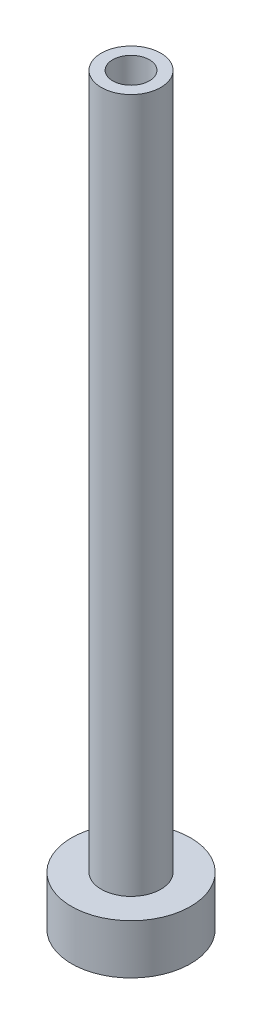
ISO-10303-21;
HEADER;
FILE_DESCRIPTION(('STEP AP214'),'2;1');
FILE_NAME('part.step','',(''),(''),'','','');
FILE_SCHEMA(('AUTOMOTIVE_DESIGN { 1 0 10303 214 1 1 1 1 }'));
ENDSEC;
DATA;
#1=APPLICATION_CONTEXT('core data for automotive mechanical design processes');
#2=APPLICATION_PROTOCOL_DEFINITION('international standard','automotive_design',2000,#1);
#3=PRODUCT_CONTEXT('',#1,'mechanical');
#4=PRODUCT('Part','Part','',(#3));
#5=PRODUCT_RELATED_PRODUCT_CATEGORY('part','',(#4));
#6=PRODUCT_DEFINITION_FORMATION('','',#4);
#7=PRODUCT_DEFINITION_CONTEXT('part definition',#1,'design');
#8=PRODUCT_DEFINITION('design','',#6,#7);
#9=PRODUCT_DEFINITION_SHAPE('','',#8);
#10=(LENGTH_UNIT() NAMED_UNIT(*) SI_UNIT(.MILLI.,.METRE.));
#11=(NAMED_UNIT(*) PLANE_ANGLE_UNIT() SI_UNIT($,.RADIAN.));
#12=(NAMED_UNIT(*) SI_UNIT($,.STERADIAN.) SOLID_ANGLE_UNIT());
#13=UNCERTAINTY_MEASURE_WITH_UNIT(LENGTH_MEASURE(1.E-05),#10,'distance_accuracy_value','');
#14=(GEOMETRIC_REPRESENTATION_CONTEXT(3) GLOBAL_UNCERTAINTY_ASSIGNED_CONTEXT((#13)) GLOBAL_UNIT_ASSIGNED_CONTEXT((#10,
#11,#12)) REPRESENTATION_CONTEXT('',''));
#15=CARTESIAN_POINT('',(0.,0.,0.));
#16=DIRECTION('',(0.,0.,1.));
#17=DIRECTION('',(1.,0.,0.));
#18=AXIS2_PLACEMENT_3D('',#15,#16,#17);
#19=CARTESIAN_POINT('',(0.,0.,0.));
#20=DIRECTION('',(0.,-1.,0.));
#21=DIRECTION('',(0.,0.,-1.));
#22=AXIS2_PLACEMENT_3D('',#19,#20,#21);
#23=CYLINDRICAL_SURFACE('',#22,6.);
#24=CARTESIAN_POINT('',(0.,-5.,0.));
#25=DIRECTION('',(0.,-1.,0.));
#26=DIRECTION('',(0.,0.,-1.));
#27=AXIS2_PLACEMENT_3D('',#24,#25,#26);
#28=CIRCLE('',#27,6.);
#29=CARTESIAN_POINT('',(0.,-5.,-6.));
#30=VERTEX_POINT('',#29);
#31=EDGE_CURVE('E42',#30,#30,#28,.T.);
#32=ORIENTED_EDGE('',*,*,#31,.F.);
#33=EDGE_LOOP('',(#32));
#34=FACE_BOUND('',#33,.T.);
#35=CARTESIAN_POINT('',(0.,0.,0.));
#36=DIRECTION('',(0.,-1.,0.));
#37=DIRECTION('',(0.,0.,-1.));
#38=AXIS2_PLACEMENT_3D('',#35,#36,#37);
#39=CIRCLE('',#38,6.);
#40=CARTESIAN_POINT('',(0.,0.,-6.));
#41=VERTEX_POINT('',#40);
#42=EDGE_CURVE('E9',#41,#41,#39,.T.);
#43=ORIENTED_EDGE('',*,*,#42,.T.);
#44=EDGE_LOOP('',(#43));
#45=FACE_BOUND('',#44,.T.);
#46=ADVANCED_FACE('F14',(#34,#45),#23,.T.);
#47=CARTESIAN_POINT('',(-6.,0.,0.));
#48=DIRECTION('',(0.,-1.,0.));
#49=DIRECTION('',(0.,0.,-1.));
#50=AXIS2_PLACEMENT_3D('',#47,#48,#49);
#51=PLANE('',#50);
#52=ORIENTED_EDGE('',*,*,#42,.F.);
#53=EDGE_LOOP('',(#52));
#54=FACE_BOUND('',#53,.T.);
#55=CARTESIAN_POINT('',(0.,0.,0.));
#56=DIRECTION('',(0.,-1.,0.));
#57=DIRECTION('',(0.,0.,-1.));
#58=AXIS2_PLACEMENT_3D('',#55,#56,#57);
#59=CIRCLE('',#58,3.);
#60=CARTESIAN_POINT('',(0.,0.,-3.));
#61=VERTEX_POINT('',#60);
#62=EDGE_CURVE('E20',#61,#61,#59,.T.);
#63=ORIENTED_EDGE('',*,*,#62,.T.);
#64=EDGE_LOOP('',(#63));
#65=FACE_BOUND('',#64,.T.);
#66=ADVANCED_FACE('F49',(#54,#65),#51,.F.);
#67=CARTESIAN_POINT('',(0.,0.,0.));
#68=DIRECTION('',(0.,-1.,0.));
#69=DIRECTION('',(0.,0.,-1.));
#70=AXIS2_PLACEMENT_3D('',#67,#68,#69);
#71=CYLINDRICAL_SURFACE('',#70,3.);
#72=ORIENTED_EDGE('',*,*,#62,.F.);
#73=EDGE_LOOP('',(#72));
#74=FACE_BOUND('',#73,.T.);
#75=CARTESIAN_POINT('',(0.,70.,0.));
#76=DIRECTION('',(0.,-1.,0.));
#77=DIRECTION('',(0.,0.,-1.));
#78=AXIS2_PLACEMENT_3D('',#75,#76,#77);
#79=CIRCLE('',#78,3.);
#80=CARTESIAN_POINT('',(0.,70.,-3.));
#81=VERTEX_POINT('',#80);
#82=EDGE_CURVE('E24',#81,#81,#79,.T.);
#83=ORIENTED_EDGE('',*,*,#82,.T.);
#84=EDGE_LOOP('',(#83));
#85=FACE_BOUND('',#84,.T.);
#86=ADVANCED_FACE('F55',(#74,#85),#71,.T.);
#87=CARTESIAN_POINT('',(-3.,70.,0.));
#88=DIRECTION('',(0.,-1.,0.));
#89=DIRECTION('',(0.,0.,-1.));
#90=AXIS2_PLACEMENT_3D('',#87,#88,#89);
#91=PLANE('',#90);
#92=ORIENTED_EDGE('',*,*,#82,.F.);
#93=EDGE_LOOP('',(#92));
#94=FACE_BOUND('',#93,.T.);
#95=CARTESIAN_POINT('',(0.,70.,0.));
#96=DIRECTION('',(0.,-1.,0.));
#97=DIRECTION('',(0.,0.,-1.));
#98=AXIS2_PLACEMENT_3D('',#95,#96,#97);
#99=CIRCLE('',#98,1.85);
#100=CARTESIAN_POINT('',(0.,70.,-1.85));
#101=VERTEX_POINT('',#100);
#102=EDGE_CURVE('E28',#101,#101,#99,.T.);
#103=ORIENTED_EDGE('',*,*,#102,.T.);
#104=EDGE_LOOP('',(#103));
#105=FACE_BOUND('',#104,.T.);
#106=ADVANCED_FACE('F61',(#94,#105),#91,.F.);
#107=CARTESIAN_POINT('',(0.,0.,0.));
#108=DIRECTION('',(0.,-1.,0.));
#109=DIRECTION('',(0.,0.,-1.));
#110=AXIS2_PLACEMENT_3D('',#107,#108,#109);
#111=CYLINDRICAL_SURFACE('',#110,1.85);
#112=ORIENTED_EDGE('',*,*,#102,.F.);
#113=EDGE_LOOP('',(#112));
#114=FACE_BOUND('',#113,.T.);
#115=CARTESIAN_POINT('',(0.,25.,0.));
#116=DIRECTION('',(0.,-1.,0.));
#117=DIRECTION('',(0.,0.,-1.));
#118=AXIS2_PLACEMENT_3D('',#115,#116,#117);
#119=CIRCLE('',#118,1.85);
#120=CARTESIAN_POINT('',(0.,25.,-1.85));
#121=VERTEX_POINT('',#120);
#122=EDGE_CURVE('E33',#121,#121,#119,.T.);
#123=ORIENTED_EDGE('',*,*,#122,.T.);
#124=EDGE_LOOP('',(#123));
#125=FACE_BOUND('',#124,.T.);
#126=ADVANCED_FACE('F67',(#114,#125),#111,.F.);
#127=CARTESIAN_POINT('',(0.,24.85,0.));
#128=DIRECTION('',(0.,-1.,0.));
#129=DIRECTION('',(0.,0.,-1.));
#130=AXIS2_PLACEMENT_3D('',#127,#128,#129);
#131=CONICAL_SURFACE('',#130,2.,0.785398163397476);
#132=ORIENTED_EDGE('',*,*,#122,.F.);
#133=EDGE_LOOP('',(#132));
#134=FACE_BOUND('',#133,.T.);
#135=CARTESIAN_POINT('',(0.,24.85,0.));
#136=DIRECTION('',(0.,-1.,0.));
#137=DIRECTION('',(0.,0.,-1.));
#138=AXIS2_PLACEMENT_3D('',#135,#136,#137);
#139=CIRCLE('',#138,2.);
#140=CARTESIAN_POINT('',(0.,24.85,-2.));
#141=VERTEX_POINT('',#140);
#142=EDGE_CURVE('E36',#141,#141,#139,.T.);
#143=ORIENTED_EDGE('',*,*,#142,.T.);
#144=EDGE_LOOP('',(#143));
#145=FACE_BOUND('',#144,.T.);
#146=ADVANCED_FACE('F71',(#134,#145),#131,.F.);
#147=CARTESIAN_POINT('',(0.,0.,0.));
#148=DIRECTION('',(0.,-1.,0.));
#149=DIRECTION('',(0.,0.,-1.));
#150=AXIS2_PLACEMENT_3D('',#147,#148,#149);
#151=CYLINDRICAL_SURFACE('',#150,2.);
#152=ORIENTED_EDGE('',*,*,#142,.F.);
#153=EDGE_LOOP('',(#152));
#154=FACE_BOUND('',#153,.T.);
#155=CARTESIAN_POINT('',(0.,-5.,0.));
#156=DIRECTION('',(0.,-1.,0.));
#157=DIRECTION('',(0.,0.,-1.));
#158=AXIS2_PLACEMENT_3D('',#155,#156,#157);
#159=CIRCLE('',#158,2.);
#160=CARTESIAN_POINT('',(0.,-5.,-2.));
#161=VERTEX_POINT('',#160);
#162=EDGE_CURVE('E39',#161,#161,#159,.T.);
#163=ORIENTED_EDGE('',*,*,#162,.T.);
#164=EDGE_LOOP('',(#163));
#165=FACE_BOUND('',#164,.T.);
#166=ADVANCED_FACE('F75',(#154,#165),#151,.F.);
#167=CARTESIAN_POINT('',(-2.,-5.,0.));
#168=DIRECTION('',(0.,1.,0.));
#169=DIRECTION('',(0.,0.,1.));
#170=AXIS2_PLACEMENT_3D('',#167,#168,#169);
#171=PLANE('',#170);
#172=ORIENTED_EDGE('',*,*,#162,.F.);
#173=EDGE_LOOP('',(#172));
#174=FACE_BOUND('',#173,.T.);
#175=ORIENTED_EDGE('',*,*,#31,.T.);
#176=EDGE_LOOP('',(#175));
#177=FACE_BOUND('',#176,.T.);
#178=ADVANCED_FACE('F46',(#174,#177),#171,.F.);
#179=CLOSED_SHELL('',(#46,#66,#86,#106,#126,#146,#166,#178));
#180=MANIFOLD_SOLID_BREP('B1',#179);
#181=ADVANCED_BREP_SHAPE_REPRESENTATION('',(#18,#180),#14);
#182=SHAPE_DEFINITION_REPRESENTATION(#9,#181);
ENDSEC;
END-ISO-10303-21;
